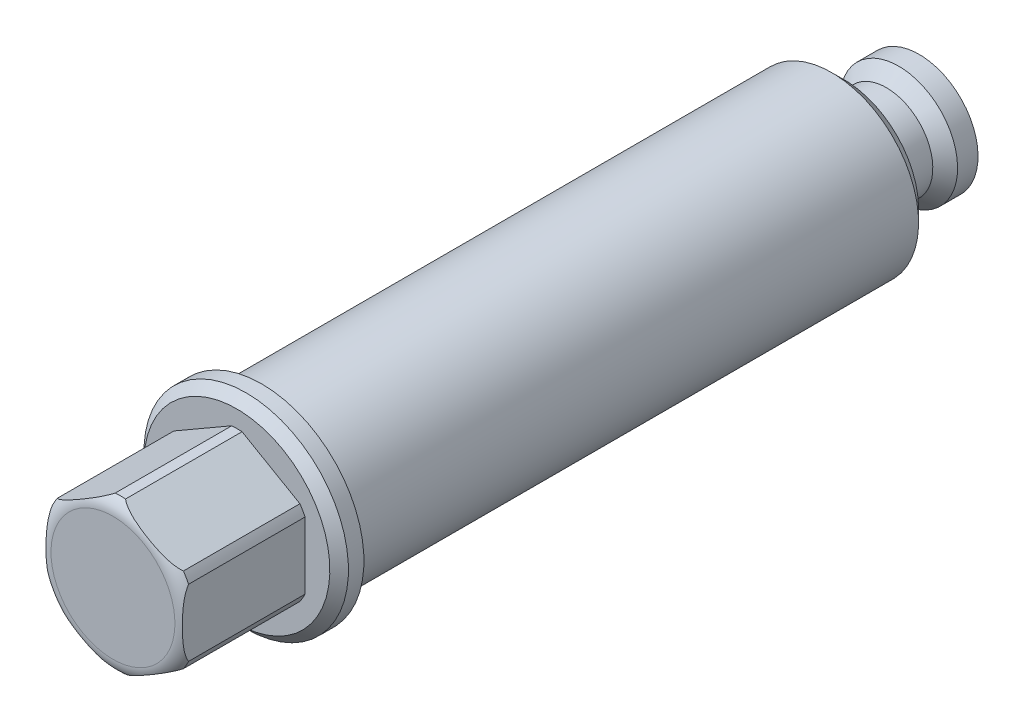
ISO-10303-21;
HEADER;
FILE_DESCRIPTION(('STEP AP214'),'2;1');
FILE_NAME('part.step','',(''),(''),'','','');
FILE_SCHEMA(('AUTOMOTIVE_DESIGN { 1 0 10303 214 1 1 1 1 }'));
ENDSEC;
DATA;
#1=APPLICATION_CONTEXT('core data for automotive mechanical design processes');
#2=APPLICATION_PROTOCOL_DEFINITION('international standard','automotive_design',2000,#1);
#3=PRODUCT_CONTEXT('',#1,'mechanical');
#4=PRODUCT('Part','Part','',(#3));
#5=PRODUCT_RELATED_PRODUCT_CATEGORY('part','',(#4));
#6=PRODUCT_DEFINITION_FORMATION('','',#4);
#7=PRODUCT_DEFINITION_CONTEXT('part definition',#1,'design');
#8=PRODUCT_DEFINITION('design','',#6,#7);
#9=PRODUCT_DEFINITION_SHAPE('','',#8);
#10=(LENGTH_UNIT() NAMED_UNIT(*) SI_UNIT(.MILLI.,.METRE.));
#11=(NAMED_UNIT(*) PLANE_ANGLE_UNIT() SI_UNIT($,.RADIAN.));
#12=(NAMED_UNIT(*) SI_UNIT($,.STERADIAN.) SOLID_ANGLE_UNIT());
#13=UNCERTAINTY_MEASURE_WITH_UNIT(LENGTH_MEASURE(1.E-05),#10,'distance_accuracy_value','');
#14=(GEOMETRIC_REPRESENTATION_CONTEXT(3) GLOBAL_UNCERTAINTY_ASSIGNED_CONTEXT((#13)) GLOBAL_UNIT_ASSIGNED_CONTEXT((#10,
#11,#12)) REPRESENTATION_CONTEXT('',''));
#15=CARTESIAN_POINT('',(0.,0.,0.));
#16=DIRECTION('',(0.,0.,1.));
#17=DIRECTION('',(1.,0.,0.));
#18=AXIS2_PLACEMENT_3D('',#15,#16,#17);
#19=CARTESIAN_POINT('',(11.,-6.35085296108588,133.));
#20=DIRECTION('',(0.,0.,-1.));
#21=DIRECTION('',(-0.866025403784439,0.5,0.));
#22=AXIS2_PLACEMENT_3D('',#19,#20,#21);
#23=PLANE('',#22);
#24=CARTESIAN_POINT('',(0.,0.,133.));
#25=DIRECTION('',(0.,0.,-1.));
#26=DIRECTION('',(0.866025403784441,-0.499999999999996,0.));
#27=AXIS2_PLACEMENT_3D('',#24,#25,#26);
#28=CIRCLE('',#27,10.);
#29=CARTESIAN_POINT('',(8.66025403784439,-5.,133.));
#30=VERTEX_POINT('',#29);
#31=CARTESIAN_POINT('',(-8.66025403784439,5.,133.));
#32=VERTEX_POINT('',#31);
#33=EDGE_CURVE('E180',#30,#32,#28,.T.);
#34=ORIENTED_EDGE('',*,*,#33,.F.);
#35=CARTESIAN_POINT('',(0.,0.,133.));
#36=DIRECTION('',(0.,0.,-1.));
#37=DIRECTION('',(-0.86602540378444,0.499999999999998,0.));
#38=AXIS2_PLACEMENT_3D('',#35,#36,#37);
#39=CIRCLE('',#38,10.);
#40=EDGE_CURVE('E273',#32,#30,#39,.T.);
#41=ORIENTED_EDGE('',*,*,#40,.F.);
#42=EDGE_LOOP('',(#34,#41));
#43=FACE_BOUND('',#42,.T.);
#44=ADVANCED_FACE('F14',(#43),#23,.F.);
#45=CARTESIAN_POINT('',(0.,0.,133.));
#46=DIRECTION('',(0.,0.,1.));
#47=DIRECTION('',(0.866025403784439,-0.5,0.));
#48=AXIS2_PLACEMENT_3D('',#45,#46,#47);
#49=CYLINDRICAL_SURFACE('',#48,12.25);
#50=DIRECTION('',(0.,0.,1.));
#51=VECTOR('',#50,1.);
#52=CARTESIAN_POINT('',(11.,-5.39096466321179,113.));
#53=LINE('',#52,#51);
#54=CARTESIAN_POINT('',(11.,-5.39096466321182,131.793859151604));
#55=VERTEX_POINT('',#54);
#56=CARTESIAN_POINT('',(11.,-5.39096466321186,113.));
#57=VERTEX_POINT('',#56);
#58=EDGE_CURVE('E172',#55,#57,#53,.F.);
#59=ORIENTED_EDGE('',*,*,#58,.F.);
#60=CARTESIAN_POINT('',(0.,0.,131.793859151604));
#61=DIRECTION('',(0.,0.,1.));
#62=DIRECTION('',(0.866025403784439,-0.5,0.));
#63=AXIS2_PLACEMENT_3D('',#60,#61,#62);
#64=CIRCLE('',#63,12.25);
#65=CARTESIAN_POINT('',(10.1687123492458,-6.83079711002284,131.793859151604));
#66=VERTEX_POINT('',#65);
#67=EDGE_CURVE('E129',#66,#55,#64,.T.);
#68=ORIENTED_EDGE('',*,*,#67,.F.);
#69=DIRECTION('',(0.,0.,1.));
#70=VECTOR('',#69,1.);
#71=CARTESIAN_POINT('',(10.1687123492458,-6.83079711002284,113.));
#72=LINE('',#71,#70);
#73=CARTESIAN_POINT('',(10.1687123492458,-6.83079711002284,113.));
#74=VERTEX_POINT('',#73);
#75=EDGE_CURVE('E127',#74,#66,#72,.T.);
#76=ORIENTED_EDGE('',*,*,#75,.F.);
#77=CARTESIAN_POINT('',(0.,0.,113.));
#78=DIRECTION('',(0.,0.,1.));
#79=DIRECTION('',(0.866025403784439,-0.5,0.));
#80=AXIS2_PLACEMENT_3D('',#77,#78,#79);
#81=CIRCLE('',#80,12.25);
#82=EDGE_CURVE('E112',#74,#57,#81,.T.);
#83=ORIENTED_EDGE('',*,*,#82,.T.);
#84=EDGE_LOOP('',(#59,#68,#76,#83));
#85=FACE_BOUND('',#84,.T.);
#86=ADVANCED_FACE('F128',(#85),#49,.T.);
#87=CARTESIAN_POINT('',(0.,0.,133.));
#88=DIRECTION('',(0.,0.,1.));
#89=DIRECTION('',(0.866025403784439,-0.5,0.));
#90=AXIS2_PLACEMENT_3D('',#87,#88,#89);
#91=CYLINDRICAL_SURFACE('',#90,12.25);
#92=CARTESIAN_POINT('',(0.,0.,131.793859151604));
#93=DIRECTION('',(0.,0.,1.));
#94=DIRECTION('',(0.866025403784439,-0.5,0.));
#95=AXIS2_PLACEMENT_3D('',#92,#93,#94);
#96=CIRCLE('',#95,12.25);
#97=CARTESIAN_POINT('',(11.,5.39096466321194,131.793859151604));
#98=VERTEX_POINT('',#97);
#99=CARTESIAN_POINT('',(10.1687123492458,6.83079711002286,131.793859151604));
#100=VERTEX_POINT('',#99);
#101=EDGE_CURVE('E271',#98,#100,#96,.T.);
#102=ORIENTED_EDGE('',*,*,#101,.F.);
#103=DIRECTION('',(0.,0.,1.));
#104=VECTOR('',#103,1.);
#105=CARTESIAN_POINT('',(11.,5.39096466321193,113.));
#106=LINE('',#105,#104);
#107=CARTESIAN_POINT('',(11.,5.39096466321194,113.));
#108=VERTEX_POINT('',#107);
#109=EDGE_CURVE('E175',#108,#98,#106,.T.);
#110=ORIENTED_EDGE('',*,*,#109,.F.);
#111=CARTESIAN_POINT('',(0.,0.,113.));
#112=DIRECTION('',(0.,0.,1.));
#113=DIRECTION('',(0.866025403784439,-0.5,0.));
#114=AXIS2_PLACEMENT_3D('',#111,#112,#113);
#115=CIRCLE('',#114,12.25);
#116=CARTESIAN_POINT('',(10.1687123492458,6.83079711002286,113.));
#117=VERTEX_POINT('',#116);
#118=EDGE_CURVE('E124',#108,#117,#115,.T.);
#119=ORIENTED_EDGE('',*,*,#118,.T.);
#120=DIRECTION('',(0.,0.,1.));
#121=VECTOR('',#120,1.);
#122=CARTESIAN_POINT('',(10.1687123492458,6.83079711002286,113.));
#123=LINE('',#122,#121);
#124=EDGE_CURVE('E165',#100,#117,#123,.F.);
#125=ORIENTED_EDGE('',*,*,#124,.F.);
#126=EDGE_LOOP('',(#102,#110,#119,#125));
#127=FACE_BOUND('',#126,.T.);
#128=ADVANCED_FACE('F262',(#127),#91,.T.);
#129=CARTESIAN_POINT('',(0.,0.,133.));
#130=DIRECTION('',(0.,0.,1.));
#131=DIRECTION('',(0.866025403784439,-0.5,0.));
#132=AXIS2_PLACEMENT_3D('',#129,#130,#131);
#133=CYLINDRICAL_SURFACE('',#132,12.25);
#134=CARTESIAN_POINT('',(0.,0.,113.));
#135=DIRECTION('',(0.,0.,1.));
#136=DIRECTION('',(0.866025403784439,-0.5,0.));
#137=AXIS2_PLACEMENT_3D('',#134,#135,#136);
#138=CIRCLE('',#137,12.25);
#139=CARTESIAN_POINT('',(0.83128765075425,12.2217617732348,113.));
#140=VERTEX_POINT('',#139);
#141=CARTESIAN_POINT('',(-0.831287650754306,12.2217617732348,113.));
#142=VERTEX_POINT('',#141);
#143=EDGE_CURVE('E317',#140,#142,#138,.T.);
#144=ORIENTED_EDGE('',*,*,#143,.T.);
#145=DIRECTION('',(0.,0.,1.));
#146=VECTOR('',#145,1.);
#147=CARTESIAN_POINT('',(-0.831287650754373,12.2217617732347,113.));
#148=LINE('',#147,#146);
#149=CARTESIAN_POINT('',(-0.831287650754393,12.2217617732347,131.793859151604));
#150=VERTEX_POINT('',#149);
#151=EDGE_CURVE('E158',#150,#142,#148,.F.);
#152=ORIENTED_EDGE('',*,*,#151,.F.);
#153=CARTESIAN_POINT('',(0.,0.,131.793859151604));
#154=DIRECTION('',(0.,0.,1.));
#155=DIRECTION('',(0.866025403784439,-0.5,0.));
#156=AXIS2_PLACEMENT_3D('',#153,#154,#155);
#157=CIRCLE('',#156,12.25);
#158=CARTESIAN_POINT('',(0.831287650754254,12.2217617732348,131.793859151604));
#159=VERTEX_POINT('',#158);
#160=EDGE_CURVE('E269',#150,#159,#157,.F.);
#161=ORIENTED_EDGE('',*,*,#160,.T.);
#162=DIRECTION('',(0.,0.,1.));
#163=VECTOR('',#162,1.);
#164=CARTESIAN_POINT('',(0.831287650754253,12.2217617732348,113.));
#165=LINE('',#164,#163);
#166=EDGE_CURVE('E169',#140,#159,#165,.T.);
#167=ORIENTED_EDGE('',*,*,#166,.F.);
#168=EDGE_LOOP('',(#144,#152,#161,#167));
#169=FACE_BOUND('',#168,.T.);
#170=ADVANCED_FACE('F261',(#169),#133,.T.);
#171=CARTESIAN_POINT('',(0.,0.,133.));
#172=DIRECTION('',(0.,0.,1.));
#173=DIRECTION('',(0.866025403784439,-0.5,0.));
#174=AXIS2_PLACEMENT_3D('',#171,#172,#173);
#175=CYLINDRICAL_SURFACE('',#174,12.25);
#176=CARTESIAN_POINT('',(0.,0.,113.));
#177=DIRECTION('',(0.,0.,1.));
#178=DIRECTION('',(0.866025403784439,-0.5,0.));
#179=AXIS2_PLACEMENT_3D('',#176,#177,#178);
#180=CIRCLE('',#179,12.25);
#181=CARTESIAN_POINT('',(-10.1687123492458,6.83079711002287,113.));
#182=VERTEX_POINT('',#181);
#183=CARTESIAN_POINT('',(-11.,5.39096466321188,113.));
#184=VERTEX_POINT('',#183);
#185=EDGE_CURVE('E314',#182,#184,#180,.T.);
#186=ORIENTED_EDGE('',*,*,#185,.T.);
#187=DIRECTION('',(0.,0.,1.));
#188=VECTOR('',#187,1.);
#189=CARTESIAN_POINT('',(-11.,5.39096466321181,113.));
#190=LINE('',#189,#188);
#191=CARTESIAN_POINT('',(-11.,5.39096466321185,131.793859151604));
#192=VERTEX_POINT('',#191);
#193=EDGE_CURVE('E151',#192,#184,#190,.F.);
#194=ORIENTED_EDGE('',*,*,#193,.F.);
#195=CARTESIAN_POINT('',(0.,0.,131.793859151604));
#196=DIRECTION('',(0.,0.,1.));
#197=DIRECTION('',(0.866025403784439,-0.5,0.));
#198=AXIS2_PLACEMENT_3D('',#195,#196,#197);
#199=CIRCLE('',#198,12.25);
#200=CARTESIAN_POINT('',(-10.1687123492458,6.83079711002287,131.793859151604));
#201=VERTEX_POINT('',#200);
#202=EDGE_CURVE('E303',#201,#192,#199,.T.);
#203=ORIENTED_EDGE('',*,*,#202,.F.);
#204=DIRECTION('',(0.,0.,1.));
#205=VECTOR('',#204,1.);
#206=CARTESIAN_POINT('',(-10.1687123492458,6.83079711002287,113.));
#207=LINE('',#206,#205);
#208=EDGE_CURVE('E162',#182,#201,#207,.T.);
#209=ORIENTED_EDGE('',*,*,#208,.F.);
#210=EDGE_LOOP('',(#186,#194,#203,#209));
#211=FACE_BOUND('',#210,.T.);
#212=ADVANCED_FACE('F484',(#211),#175,.T.);
#213=CARTESIAN_POINT('',(0.,0.,133.));
#214=DIRECTION('',(0.,0.,1.));
#215=DIRECTION('',(0.866025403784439,-0.5,0.));
#216=AXIS2_PLACEMENT_3D('',#213,#214,#215);
#217=CYLINDRICAL_SURFACE('',#216,12.25);
#218=CARTESIAN_POINT('',(0.,0.,113.));
#219=DIRECTION('',(0.,0.,1.));
#220=DIRECTION('',(0.866025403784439,-0.5,0.));
#221=AXIS2_PLACEMENT_3D('',#218,#219,#220);
#222=CIRCLE('',#221,12.25);
#223=CARTESIAN_POINT('',(-0.831287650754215,-12.2217617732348,113.));
#224=VERTEX_POINT('',#223);
#225=CARTESIAN_POINT('',(0.831287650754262,-12.2217617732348,113.));
#226=VERTEX_POINT('',#225);
#227=EDGE_CURVE('E307',#224,#226,#222,.T.);
#228=ORIENTED_EDGE('',*,*,#227,.T.);
#229=DIRECTION('',(0.,0.,1.));
#230=VECTOR('',#229,1.);
#231=CARTESIAN_POINT('',(0.831287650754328,-12.2217617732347,113.));
#232=LINE('',#231,#230);
#233=CARTESIAN_POINT('',(0.831287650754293,-12.2217617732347,131.793859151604));
#234=VERTEX_POINT('',#233);
#235=EDGE_CURVE('E139',#234,#226,#232,.F.);
#236=ORIENTED_EDGE('',*,*,#235,.F.);
#237=CARTESIAN_POINT('',(0.,0.,131.793859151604));
#238=DIRECTION('',(0.,0.,1.));
#239=DIRECTION('',(0.866025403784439,-0.5,0.));
#240=AXIS2_PLACEMENT_3D('',#237,#238,#239);
#241=CIRCLE('',#240,12.25);
#242=CARTESIAN_POINT('',(-0.831287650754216,-12.2217617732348,131.793859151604));
#243=VERTEX_POINT('',#242);
#244=EDGE_CURVE('E300',#243,#234,#241,.T.);
#245=ORIENTED_EDGE('',*,*,#244,.F.);
#246=DIRECTION('',(0.,0.,-1.));
#247=VECTOR('',#246,1.);
#248=CARTESIAN_POINT('',(-0.831287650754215,-12.2217617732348,113.));
#249=LINE('',#248,#247);
#250=EDGE_CURVE('E149',#224,#243,#249,.F.);
#251=ORIENTED_EDGE('',*,*,#250,.F.);
#252=EDGE_LOOP('',(#228,#236,#245,#251));
#253=FACE_BOUND('',#252,.T.);
#254=ADVANCED_FACE('F191',(#253),#217,.T.);
#255=CARTESIAN_POINT('',(0.,0.,130.298294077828));
#256=DIRECTION('',(0.,0.,1.));
#257=DIRECTION('',(0.866025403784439,-0.5,0.));
#258=AXIS2_PLACEMENT_3D('',#255,#256,#257);
#259=TOROIDAL_SURFACE('',#258,10.,2.70170592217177);
#260=CARTESIAN_POINT('',(-10.1687123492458,6.83079711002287,131.793859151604));
#261=CARTESIAN_POINT('',(-10.1129325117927,6.86300161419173,131.836482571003));
#262=CARTESIAN_POINT('',(-10.0559059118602,6.89592593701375,131.876855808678));
#263=CARTESIAN_POINT('',(-9.93996765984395,6.9628629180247,131.953381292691));
#264=CARTESIAN_POINT('',(-9.88106158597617,6.99687235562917,131.989544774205));
#265=CARTESIAN_POINT('',(-9.76170288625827,7.06578413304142,132.05813598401));
#266=CARTESIAN_POINT('',(-9.70125131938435,7.10068586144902,132.090566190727));
#267=CARTESIAN_POINT('',(-9.58016618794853,7.17059439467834,132.151521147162));
#268=CARTESIAN_POINT('',(-9.5195547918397,7.20558840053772,132.180104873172));
#269=CARTESIAN_POINT('',(-9.39732105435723,7.27616008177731,132.234347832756));
#270=CARTESIAN_POINT('',(-9.33569812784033,7.31173809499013,132.260005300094));
#271=CARTESIAN_POINT('',(-9.21165950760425,7.38335182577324,132.30865335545));
#272=CARTESIAN_POINT('',(-9.14924366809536,7.41938762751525,132.331643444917));
#273=CARTESIAN_POINT('',(-8.99138382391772,7.51052805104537,132.386452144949));
#274=CARTESIAN_POINT('',(-8.89552952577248,7.5658695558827,132.416698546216));
#275=CARTESIAN_POINT('',(-8.70277268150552,7.67715777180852,132.472386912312));
#276=CARTESIAN_POINT('',(-8.6058698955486,7.73310462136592,132.497827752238));
#277=CARTESIAN_POINT('',(-8.3137912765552,7.90173629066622,132.568003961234));
#278=CARTESIAN_POINT('',(-8.11749038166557,8.01507066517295,132.606511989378));
#279=CARTESIAN_POINT('',(-7.72323299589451,8.2426952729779,132.671143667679));
#280=CARTESIAN_POINT('',(-7.52527491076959,8.35698642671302,132.697253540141));
#281=CARTESIAN_POINT('',(-7.12360101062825,8.58889296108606,132.740582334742));
#282=CARTESIAN_POINT('',(-6.91986619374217,8.70651931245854,132.757559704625));
#283=CARTESIAN_POINT('',(-6.51231016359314,8.94182189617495,132.783809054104));
#284=CARTESIAN_POINT('',(-6.30848940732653,9.05949786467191,132.793091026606));
#285=CARTESIAN_POINT('',(-5.90086638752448,9.2948391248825,132.805276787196));
#286=CARTESIAN_POINT('',(-5.69706422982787,9.41250435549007,132.808185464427));
#287=CARTESIAN_POINT('',(-5.31834568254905,9.6311576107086,132.80805760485));
#288=CARTESIAN_POINT('',(-5.14342867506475,9.7321459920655,132.805805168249));
#289=CARTESIAN_POINT('',(-4.79363062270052,9.93410199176,132.796664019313));
#290=CARTESIAN_POINT('',(-4.61874960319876,10.0350695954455,132.789773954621));
#291=CARTESIAN_POINT('',(-4.26896148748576,10.2370198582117,132.770635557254));
#292=CARTESIAN_POINT('',(-4.09405468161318,10.3380023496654,132.758379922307));
#293=CARTESIAN_POINT('',(-3.74416838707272,10.5400092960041,132.727259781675));
#294=CARTESIAN_POINT('',(-3.56919009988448,10.6410330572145,132.708376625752));
#295=CARTESIAN_POINT('',(-3.22483803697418,10.8398448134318,132.662887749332));
#296=CARTESIAN_POINT('',(-3.05544239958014,10.9376454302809,132.636508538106));
#297=CARTESIAN_POINT('',(-2.71815589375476,11.132377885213,132.57369473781));
#298=CARTESIAN_POINT('',(-2.5502638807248,11.2293103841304,132.53726861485));
#299=CARTESIAN_POINT('',(-2.21755075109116,11.4214023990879,132.451677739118));
#300=CARTESIAN_POINT('',(-2.05272044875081,11.5165672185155,132.402561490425));
#301=CARTESIAN_POINT('',(-1.72770212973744,11.7042166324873,132.28800126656));
#302=CARTESIAN_POINT('',(-1.56750164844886,11.7967084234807,132.222606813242));
#303=CARTESIAN_POINT('',(-1.36101704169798,11.9159223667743,132.122343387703));
#304=CARTESIAN_POINT('',(-1.31126364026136,11.9446475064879,132.09690891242));
#305=CARTESIAN_POINT('',(-1.21270295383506,12.0015515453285,132.043669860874));
#306=CARTESIAN_POINT('',(-1.16389580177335,12.0297303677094,132.015864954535));
#307=CARTESIAN_POINT('',(-1.06692575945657,12.0857160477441,131.957391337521));
#308=CARTESIAN_POINT('',(-1.01877501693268,12.113515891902,131.926695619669));
#309=CARTESIAN_POINT('',(-0.923894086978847,12.1682954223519,131.862461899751));
#310=CARTESIAN_POINT('',(-0.87716447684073,12.1952747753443,131.828922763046));
#311=CARTESIAN_POINT('',(-0.831287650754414,12.2217617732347,131.793859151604));
#312=B_SPLINE_CURVE_WITH_KNOTS('',3,(#260,#261,#262,#263,#264,#265,#266,#267,#268,#269,#270,
#271,#272,#273,#274,#275,#276,#277,#278,#279,#280,#281,#282,#283,#284,#285,#286,#287,#288,#289,
#290,#291,#292,#293,#294,#295,#296,#297,#298,#299,#300,#301,#302,#303,#304,#305,#306,#307,#308,
#309,#310,#311),.UNSPECIFIED.,.F.,.F.,(4,2,2,2,2,2,2,2,2,2,2,2,2,2,2,2,2,2,2,2,2,2,2,2,2,4),(0.,
0.231599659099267,0.462566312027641,0.693378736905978,0.920104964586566,1.14696732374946,
1.3738720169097,1.71795811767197,2.06212466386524,2.75133882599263,3.44131710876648,
4.14874498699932,4.85525278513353,5.56121841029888,6.16713955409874,6.77323746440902,
7.38016282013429,7.98880997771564,8.58072917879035,9.17215111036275,9.76134512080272,
10.3487681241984,10.5372122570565,10.7256826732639,10.9161322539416,11.1066581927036),.UNSPECIFIED.);
#313=EDGE_CURVE('E161',#201,#150,#312,.T.);
#314=ORIENTED_EDGE('',*,*,#313,.F.);
#315=ORIENTED_EDGE('',*,*,#202,.T.);
#316=CARTESIAN_POINT('',(-11.,-5.39096466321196,131.793859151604));
#317=CARTESIAN_POINT('',(-11.,-5.32655565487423,131.836482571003));
#318=CARTESIAN_POINT('',(-11.,-5.26070700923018,131.876855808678));
#319=CARTESIAN_POINT('',(-11.,-5.12683304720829,131.953381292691));
#320=CARTESIAN_POINT('',(-11.,-5.05881417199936,131.989544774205));
#321=CARTESIAN_POINT('',(-11.,-4.92099061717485,132.05813598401));
#322=CARTESIAN_POINT('',(-11.,-4.85118716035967,132.090566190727));
#323=CARTESIAN_POINT('',(-11.,-4.71137009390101,132.151521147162));
#324=CARTESIAN_POINT('',(-11.,-4.64138208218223,132.180104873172));
#325=CARTESIAN_POINT('',(-11.,-4.50023871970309,132.234347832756));
#326=CARTESIAN_POINT('',(-11.,-4.4290826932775,132.260005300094));
#327=CARTESIAN_POINT('',(-11.,-4.28585523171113,132.30865335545));
#328=CARTESIAN_POINT('',(-10.9999999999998,-4.2137836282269,132.331643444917));
#329=CARTESIAN_POINT('',(-10.9999999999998,-4.03150278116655,132.386452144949));
#330=CARTESIAN_POINT('',(-10.9999999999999,-3.92081977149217,132.416698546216));
#331=CARTESIAN_POINT('',(-11.0000000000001,-3.69824333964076,132.472386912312));
#332=CARTESIAN_POINT('',(-11.,-3.58634964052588,132.497827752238));
#333=CARTESIAN_POINT('',(-11.,-3.24908630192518,132.568003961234));
#334=CARTESIAN_POINT('',(-11.,-3.02241755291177,132.606511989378));
#335=CARTESIAN_POINT('',(-11.,-2.56716833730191,132.671143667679));
#336=CARTESIAN_POINT('',(-11.,-2.33858602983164,132.697253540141));
#337=CARTESIAN_POINT('',(-11.,-1.87477296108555,132.740582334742));
#338=CARTESIAN_POINT('',(-11.,-1.63952025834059,132.757559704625));
#339=CARTESIAN_POINT('',(-11.,-1.16891509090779,132.783809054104));
#340=CARTESIAN_POINT('',(-11.,-0.933563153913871,132.793091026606));
#341=CARTESIAN_POINT('',(-11.,-0.462880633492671,132.805276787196));
#342=CARTESIAN_POINT('',(-11.,-0.227550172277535,132.808185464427));
#343=CARTESIAN_POINT('',(-11.,0.209756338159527,132.80805760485));
#344=CARTESIAN_POINT('',(-11.,0.41173310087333,132.805805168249));
#345=CARTESIAN_POINT('',(-11.,0.81564510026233,132.796664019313));
#346=CARTESIAN_POINT('',(-11.,1.01758030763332,132.789773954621));
#347=CARTESIAN_POINT('',(-11.,1.42148083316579,132.770635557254));
#348=CARTESIAN_POINT('',(-11.,1.62344581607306,132.758379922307));
#349=CARTESIAN_POINT('',(-11.,2.02745970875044,132.727259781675));
#350=CARTESIAN_POINT('',(-11.,2.22950723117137,132.708376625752));
#351=CARTESIAN_POINT('',(-11.,2.62713074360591,132.662887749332));
#352=CARTESIAN_POINT('',(-11.0000000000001,2.82273197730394,132.636508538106));
#353=CARTESIAN_POINT('',(-10.9999999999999,3.21219688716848,132.57369473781));
#354=CARTESIAN_POINT('',(-10.9999999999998,3.40606188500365,132.53726861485));
#355=CARTESIAN_POINT('',(-11.0000000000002,3.79024591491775,132.451677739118));
#356=CARTESIAN_POINT('',(-11.0000000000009,3.98057555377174,132.402561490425));
#357=CARTESIAN_POINT('',(-10.9999999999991,4.35587438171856,132.28800126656));
#358=CARTESIAN_POINT('',(-10.9999999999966,4.54085796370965,132.222606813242));
#359=CARTESIAN_POINT('',(-10.9999999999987,4.77928585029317,132.122343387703));
#360=CARTESIAN_POINT('',(-10.9999999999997,4.83673612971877,132.09690891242));
#361=CARTESIAN_POINT('',(-11.0000000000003,4.95054420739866,132.043669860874));
#362=CARTESIAN_POINT('',(-11.0000000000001,5.00690185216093,132.015864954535));
#363=CARTESIAN_POINT('',(-10.9999999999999,5.11887321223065,131.957391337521));
#364=CARTESIAN_POINT('',(-10.9999999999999,5.17447290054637,131.926695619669));
#365=CARTESIAN_POINT('',(-11.,5.28403196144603,131.862461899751));
#366=CARTESIAN_POINT('',(-11.0000000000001,5.33799066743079,131.828922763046));
#367=CARTESIAN_POINT('',(-11.,5.39096466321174,131.793859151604));
#368=B_SPLINE_CURVE_WITH_KNOTS('',3,(#316,#317,#318,#319,#320,#321,#322,#323,#324,#325,#326,
#327,#328,#329,#330,#331,#332,#333,#334,#335,#336,#337,#338,#339,#340,#341,#342,#343,#344,#345,
#346,#347,#348,#349,#350,#351,#352,#353,#354,#355,#356,#357,#358,#359,#360,#361,#362,#363,#364,
#365,#366,#367),.UNSPECIFIED.,.F.,.F.,(4,2,2,2,2,2,2,2,2,2,2,2,2,2,2,2,2,2,2,2,2,2,2,2,2,4),(0.,
0.231599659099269,0.462566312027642,0.693378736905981,0.920104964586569,1.14696732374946,
1.3738720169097,1.71795811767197,2.06212466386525,2.75133882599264,3.44131710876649,
4.14874498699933,4.85525278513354,5.56121841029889,6.16713955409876,6.77323746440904,
7.38016282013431,7.98880997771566,8.58072917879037,9.17215111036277,9.76134512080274,
10.3487681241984,10.5372122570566,10.7256826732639,10.9161322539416,11.1066581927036),.UNSPECIFIED.);
#369=CARTESIAN_POINT('',(-11.,-5.39096466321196,131.793859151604));
#370=VERTEX_POINT('',#369);
#371=EDGE_CURVE('E154',#370,#192,#368,.T.);
#372=ORIENTED_EDGE('',*,*,#371,.F.);
#373=CARTESIAN_POINT('',(0.,0.,131.793859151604));
#374=DIRECTION('',(0.,0.,1.));
#375=DIRECTION('',(0.866025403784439,-0.5,0.));
#376=AXIS2_PLACEMENT_3D('',#373,#374,#375);
#377=CIRCLE('',#376,12.25);
#378=CARTESIAN_POINT('',(-10.1687123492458,-6.83079711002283,131.793859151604));
#379=VERTEX_POINT('',#378);
#380=EDGE_CURVE('E178',#379,#370,#377,.F.);
#381=ORIENTED_EDGE('',*,*,#380,.F.);
#382=CARTESIAN_POINT('',(-0.83128765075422,-12.2217617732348,131.793859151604));
#383=CARTESIAN_POINT('',(-0.887067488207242,-12.1895572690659,131.836482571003));
#384=CARTESIAN_POINT('',(-0.944094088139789,-12.1566329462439,131.876855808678));
#385=CARTESIAN_POINT('',(-1.06003234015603,-12.089695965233,131.953381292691));
#386=CARTESIAN_POINT('',(-1.11893841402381,-12.0556865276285,131.989544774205));
#387=CARTESIAN_POINT('',(-1.23829711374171,-11.9867747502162,132.05813598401));
#388=CARTESIAN_POINT('',(-1.29874868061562,-11.9518730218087,132.090566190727));
#389=CARTESIAN_POINT('',(-1.41983381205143,-11.8819644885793,132.151521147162));
#390=CARTESIAN_POINT('',(-1.48044520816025,-11.8469704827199,132.180104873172));
#391=CARTESIAN_POINT('',(-1.60267894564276,-11.7763988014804,132.234347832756));
#392=CARTESIAN_POINT('',(-1.6643018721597,-11.7408207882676,132.260005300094));
#393=CARTESIAN_POINT('',(-1.78834049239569,-11.6692070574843,132.30865335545));
#394=CARTESIAN_POINT('',(-1.85075633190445,-11.6331712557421,132.331643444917));
#395=CARTESIAN_POINT('',(-2.00861617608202,-11.5420308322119,132.386452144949));
#396=CARTESIAN_POINT('',(-2.10447047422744,-11.4866893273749,132.416698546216));
#397=CARTESIAN_POINT('',(-2.29722731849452,-11.3754011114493,132.472386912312));
#398=CARTESIAN_POINT('',(-2.39413010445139,-11.3194542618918,132.497827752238));
#399=CARTESIAN_POINT('',(-2.68620872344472,-11.1508225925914,132.568003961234));
#400=CARTESIAN_POINT('',(-2.88250961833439,-11.0374882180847,132.606511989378));
#401=CARTESIAN_POINT('',(-3.27676700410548,-10.8098636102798,132.671143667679));
#402=CARTESIAN_POINT('',(-3.47472508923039,-10.6955724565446,132.697253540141));
#403=CARTESIAN_POINT('',(-3.87639898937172,-10.4636659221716,132.740582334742));
#404=CARTESIAN_POINT('',(-4.0801338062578,-10.3460395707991,132.757559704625));
#405=CARTESIAN_POINT('',(-4.48768983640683,-10.1107369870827,132.783809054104));
#406=CARTESIAN_POINT('',(-4.69151059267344,-9.99306101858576,132.793091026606));
#407=CARTESIAN_POINT('',(-5.09913361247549,-9.75771975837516,132.805276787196));
#408=CARTESIAN_POINT('',(-5.3029357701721,-9.6400545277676,132.808185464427));
#409=CARTESIAN_POINT('',(-5.68165431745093,-9.42140127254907,132.80805760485));
#410=CARTESIAN_POINT('',(-5.85657132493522,-9.32041289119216,132.805805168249));
#411=CARTESIAN_POINT('',(-6.20636937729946,-9.11845689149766,132.796664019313));
#412=CARTESIAN_POINT('',(-6.38125039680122,-9.01748928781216,132.789773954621));
#413=CARTESIAN_POINT('',(-6.73103851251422,-8.81553902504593,132.770635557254));
#414=CARTESIAN_POINT('',(-6.90594531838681,-8.7145565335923,132.758379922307));
#415=CARTESIAN_POINT('',(-7.25583161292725,-8.5125495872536,132.727259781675));
#416=CARTESIAN_POINT('',(-7.43080990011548,-8.41152582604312,132.708376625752));
#417=CARTESIAN_POINT('',(-7.77516196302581,-8.21271406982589,132.662887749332));
#418=CARTESIAN_POINT('',(-7.9445576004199,-8.11491345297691,132.636508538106));
#419=CARTESIAN_POINT('',(-8.28184410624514,-7.92018099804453,132.57369473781));
#420=CARTESIAN_POINT('',(-8.44973611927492,-7.82324849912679,132.53726861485));
#421=CARTESIAN_POINT('',(-8.78244924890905,-7.63115648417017,132.451677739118));
#422=CARTESIAN_POINT('',(-8.94727955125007,-7.53599166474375,132.402561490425));
#423=CARTESIAN_POINT('',(-9.27229787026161,-7.34834225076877,132.28800126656));
#424=CARTESIAN_POINT('',(-9.43249835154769,-7.25585045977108,132.222606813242));
#425=CARTESIAN_POINT('',(-9.63898295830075,-7.13663651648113,132.122343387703));
#426=CARTESIAN_POINT('',(-9.68873635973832,-7.10791137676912,132.09690891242));
#427=CARTESIAN_POINT('',(-9.78729704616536,-7.05100733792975,132.043669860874));
#428=CARTESIAN_POINT('',(-9.83610419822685,-7.02282851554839,132.015864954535));
#429=CARTESIAN_POINT('',(-9.93307424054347,-6.96684283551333,131.957391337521));
#430=CARTESIAN_POINT('',(-9.98122498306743,-6.9390429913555,131.926695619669));
#431=CARTESIAN_POINT('',(-10.0761059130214,-6.88426346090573,131.862461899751));
#432=CARTESIAN_POINT('',(-10.1228355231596,-6.85728410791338,131.828922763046));
#433=CARTESIAN_POINT('',(-10.1687123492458,-6.83079711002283,131.793859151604));
#434=B_SPLINE_CURVE_WITH_KNOTS('',3,(#382,#383,#384,#385,#386,#387,#388,#389,#390,#391,#392,
#393,#394,#395,#396,#397,#398,#399,#400,#401,#402,#403,#404,#405,#406,#407,#408,#409,#410,#411,
#412,#413,#414,#415,#416,#417,#418,#419,#420,#421,#422,#423,#424,#425,#426,#427,#428,#429,#430,
#431,#432,#433),.UNSPECIFIED.,.F.,.F.,(4,2,2,2,2,2,2,2,2,2,2,2,2,2,2,2,2,2,2,2,2,2,2,2,2,4),(0.,
0.231599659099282,0.462566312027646,0.693378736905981,0.920104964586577,1.14696732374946,
1.3738720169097,1.71795811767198,2.06212466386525,2.75133882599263,3.44131710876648,
4.14874498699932,4.85525278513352,5.56121841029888,6.16713955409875,6.77323746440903,
7.3801628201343,7.98880997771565,8.58072917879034,9.17215111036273,9.76134512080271,
10.3487681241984,10.5372122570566,10.725682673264,10.9161322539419,11.1066581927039),.UNSPECIFIED.);
#435=EDGE_CURVE('E145',#243,#379,#434,.T.);
#436=ORIENTED_EDGE('',*,*,#435,.F.);
#437=ORIENTED_EDGE('',*,*,#244,.T.);
#438=CARTESIAN_POINT('',(10.1687123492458,-6.83079711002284,131.793859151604));
#439=CARTESIAN_POINT('',(10.1129325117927,-6.8630016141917,131.836482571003));
#440=CARTESIAN_POINT('',(10.0559059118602,-6.89592593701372,131.876855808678));
#441=CARTESIAN_POINT('',(9.93996765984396,-6.96286291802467,131.953381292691));
#442=CARTESIAN_POINT('',(9.88106158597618,-6.99687235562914,131.989544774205));
#443=CARTESIAN_POINT('',(9.76170288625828,-7.06578413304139,132.05813598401));
#444=CARTESIAN_POINT('',(9.70125131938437,-7.10068586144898,132.090566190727));
#445=CARTESIAN_POINT('',(9.58016618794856,-7.1705943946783,132.151521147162));
#446=CARTESIAN_POINT('',(9.51955479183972,-7.20558840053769,132.180104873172));
#447=CARTESIAN_POINT('',(9.39732105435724,-7.27616008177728,132.234347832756));
#448=CARTESIAN_POINT('',(9.33569812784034,-7.3117380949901,132.260005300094));
#449=CARTESIAN_POINT('',(9.21165950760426,-7.38335182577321,132.30865335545));
#450=CARTESIAN_POINT('',(9.14924366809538,-7.41938762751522,132.331643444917));
#451=CARTESIAN_POINT('',(8.99138382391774,-7.51052805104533,132.386452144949));
#452=CARTESIAN_POINT('',(8.89552952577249,-7.56586955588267,132.416698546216));
#453=CARTESIAN_POINT('',(8.70277268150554,-7.67715777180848,132.472386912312));
#454=CARTESIAN_POINT('',(8.60586989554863,-7.73310462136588,132.497827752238));
#455=CARTESIAN_POINT('',(8.31379127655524,-7.90173629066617,132.568003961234));
#456=CARTESIAN_POINT('',(8.1174903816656,-8.01507066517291,132.606511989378));
#457=CARTESIAN_POINT('',(7.72323299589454,-8.24269527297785,132.671143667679));
#458=CARTESIAN_POINT('',(7.52527491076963,-8.35698642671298,132.697253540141));
#459=CARTESIAN_POINT('',(7.12360101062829,-8.58889296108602,132.740582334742));
#460=CARTESIAN_POINT('',(6.91986619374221,-8.7065193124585,132.757559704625));
#461=CARTESIAN_POINT('',(6.51231016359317,-8.9418218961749,132.783809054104));
#462=CARTESIAN_POINT('',(6.30848940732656,-9.05949786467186,132.793091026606));
#463=CARTESIAN_POINT('',(5.90086638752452,-9.29483912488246,132.805276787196));
#464=CARTESIAN_POINT('',(5.69706422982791,-9.41250435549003,132.808185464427));
#465=CARTESIAN_POINT('',(5.31834568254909,-9.63115761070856,132.80805760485));
#466=CARTESIAN_POINT('',(5.14342867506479,-9.73214599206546,132.805805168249));
#467=CARTESIAN_POINT('',(4.79363062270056,-9.93410199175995,132.796664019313));
#468=CARTESIAN_POINT('',(4.6187496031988,-10.0350695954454,132.789773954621));
#469=CARTESIAN_POINT('',(4.2689614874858,-10.2370198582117,132.770635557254));
#470=CARTESIAN_POINT('',(4.09405468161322,-10.3380023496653,132.758379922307));
#471=CARTESIAN_POINT('',(3.74416838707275,-10.540009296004,132.727259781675));
#472=CARTESIAN_POINT('',(3.5691900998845,-10.6410330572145,132.708376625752));
#473=CARTESIAN_POINT('',(3.22483803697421,-10.8398448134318,132.662887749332));
#474=CARTESIAN_POINT('',(3.05544239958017,-10.9376454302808,132.636508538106));
#475=CARTESIAN_POINT('',(2.71815589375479,-11.132377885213,132.57369473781));
#476=CARTESIAN_POINT('',(2.55026388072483,-11.2293103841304,132.53726861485));
#477=CARTESIAN_POINT('',(2.21755075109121,-11.4214023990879,132.451677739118));
#478=CARTESIAN_POINT('',(2.05272044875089,-11.5165672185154,132.402561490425));
#479=CARTESIAN_POINT('',(1.72770212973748,-11.7042166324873,132.28800126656));
#480=CARTESIAN_POINT('',(1.56750164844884,-11.7967084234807,132.222606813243));
#481=CARTESIAN_POINT('',(1.36101704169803,-11.9159223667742,132.122343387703));
#482=CARTESIAN_POINT('',(1.31126364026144,-11.9446475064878,132.09690891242));
#483=CARTESIAN_POINT('',(1.21270295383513,-12.0015515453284,132.043669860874));
#484=CARTESIAN_POINT('',(1.1638958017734,-12.0297303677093,132.015864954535));
#485=CARTESIAN_POINT('',(1.06692575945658,-12.085716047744,131.957391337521));
#486=CARTESIAN_POINT('',(1.01877501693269,-12.1135158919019,131.926695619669));
#487=CARTESIAN_POINT('',(0.923894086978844,-12.1682954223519,131.862461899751));
#488=CARTESIAN_POINT('',(0.877164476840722,-12.1952747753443,131.828922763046));
#489=CARTESIAN_POINT('',(0.831287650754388,-12.2217617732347,131.793859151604));
#490=B_SPLINE_CURVE_WITH_KNOTS('',3,(#438,#439,#440,#441,#442,#443,#444,#445,#446,#447,#448,
#449,#450,#451,#452,#453,#454,#455,#456,#457,#458,#459,#460,#461,#462,#463,#464,#465,#466,#467,
#468,#469,#470,#471,#472,#473,#474,#475,#476,#477,#478,#479,#480,#481,#482,#483,#484,#485,#486,
#487,#488,#489),.UNSPECIFIED.,.F.,.F.,(4,2,2,2,2,2,2,2,2,2,2,2,2,2,2,2,2,2,2,2,2,2,2,2,2,4),(0.,
0.231599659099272,0.462566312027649,0.693378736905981,0.920104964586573,1.14696732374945,
1.3738720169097,1.71795811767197,2.06212466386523,2.75133882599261,3.44131710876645,
4.1487449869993,4.85525278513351,5.56121841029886,6.16713955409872,6.77323746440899,
7.38016282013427,7.98880997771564,8.58072917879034,9.17215111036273,9.76134512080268,
10.3487681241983,10.5372122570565,10.7256826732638,10.9161322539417,11.1066581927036),.UNSPECIFIED.);
#491=EDGE_CURVE('E133',#66,#234,#490,.T.);
#492=ORIENTED_EDGE('',*,*,#491,.F.);
#493=ORIENTED_EDGE('',*,*,#67,.T.);
#494=CARTESIAN_POINT('',(11.,5.39096466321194,131.793859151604));
#495=CARTESIAN_POINT('',(11.,5.32655565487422,131.836482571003));
#496=CARTESIAN_POINT('',(11.,5.26070700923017,131.876855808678));
#497=CARTESIAN_POINT('',(11.,5.12683304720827,131.953381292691));
#498=CARTESIAN_POINT('',(11.,5.05881417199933,131.989544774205));
#499=CARTESIAN_POINT('',(11.,4.92099061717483,132.05813598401));
#500=CARTESIAN_POINT('',(11.,4.85118716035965,132.090566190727));
#501=CARTESIAN_POINT('',(11.,4.711370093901,132.151521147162));
#502=CARTESIAN_POINT('',(11.,4.64138208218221,132.180104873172));
#503=CARTESIAN_POINT('',(11.,4.50023871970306,132.234347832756));
#504=CARTESIAN_POINT('',(11.,4.42908269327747,132.260005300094));
#505=CARTESIAN_POINT('',(11.,4.28585523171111,132.30865335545));
#506=CARTESIAN_POINT('',(10.9999999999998,4.21378362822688,132.331643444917));
#507=CARTESIAN_POINT('',(10.9999999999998,4.03150278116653,132.386452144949));
#508=CARTESIAN_POINT('',(10.9999999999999,3.92081977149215,132.416698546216));
#509=CARTESIAN_POINT('',(11.0000000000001,3.69824333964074,132.472386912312));
#510=CARTESIAN_POINT('',(11.,3.58634964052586,132.497827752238));
#511=CARTESIAN_POINT('',(11.,3.24908630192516,132.568003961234));
#512=CARTESIAN_POINT('',(11.,3.02241755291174,132.606511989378));
#513=CARTESIAN_POINT('',(11.,2.56716833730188,132.671143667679));
#514=CARTESIAN_POINT('',(11.,2.33858602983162,132.697253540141));
#515=CARTESIAN_POINT('',(11.,1.87477296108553,132.740582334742));
#516=CARTESIAN_POINT('',(11.,1.63952025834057,132.757559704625));
#517=CARTESIAN_POINT('',(11.,1.16891509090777,132.783809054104));
#518=CARTESIAN_POINT('',(11.,0.933563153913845,132.793091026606));
#519=CARTESIAN_POINT('',(11.,0.462880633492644,132.805276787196));
#520=CARTESIAN_POINT('',(11.,0.227550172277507,132.808185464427));
#521=CARTESIAN_POINT('',(11.,-0.209756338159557,132.80805760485));
#522=CARTESIAN_POINT('',(11.,-0.411733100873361,132.805805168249));
#523=CARTESIAN_POINT('',(11.,-0.815645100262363,132.796664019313));
#524=CARTESIAN_POINT('',(11.,-1.01758030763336,132.789773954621));
#525=CARTESIAN_POINT('',(11.,-1.42148083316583,132.770635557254));
#526=CARTESIAN_POINT('',(11.,-1.6234458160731,132.758379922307));
#527=CARTESIAN_POINT('',(11.,-2.02745970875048,132.727259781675));
#528=CARTESIAN_POINT('',(11.,-2.22950723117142,132.708376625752));
#529=CARTESIAN_POINT('',(11.,-2.62713074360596,132.662887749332));
#530=CARTESIAN_POINT('',(11.0000000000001,-2.82273197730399,132.636508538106));
#531=CARTESIAN_POINT('',(10.9999999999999,-3.21219688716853,132.57369473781));
#532=CARTESIAN_POINT('',(10.9999999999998,-3.4060618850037,132.53726861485));
#533=CARTESIAN_POINT('',(11.0000000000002,-3.79024591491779,132.451677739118));
#534=CARTESIAN_POINT('',(11.0000000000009,-3.98057555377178,132.402561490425));
#535=CARTESIAN_POINT('',(10.9999999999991,-4.3558743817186,132.28800126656));
#536=CARTESIAN_POINT('',(10.9999999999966,-4.54085796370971,132.222606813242));
#537=CARTESIAN_POINT('',(10.9999999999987,-4.7792858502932,132.122343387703));
#538=CARTESIAN_POINT('',(10.9999999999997,-4.83673612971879,132.09690891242));
#539=CARTESIAN_POINT('',(11.0000000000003,-4.95054420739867,132.043669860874));
#540=CARTESIAN_POINT('',(11.0000000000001,-5.00690185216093,132.015864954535));
#541=CARTESIAN_POINT('',(10.9999999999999,-5.11887321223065,131.957391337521));
#542=CARTESIAN_POINT('',(10.9999999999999,-5.17447290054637,131.926695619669));
#543=CARTESIAN_POINT('',(11.,-5.28403196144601,131.862461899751));
#544=CARTESIAN_POINT('',(11.0000000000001,-5.33799066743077,131.828922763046));
#545=CARTESIAN_POINT('',(11.,-5.39096466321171,131.793859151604));
#546=B_SPLINE_CURVE_WITH_KNOTS('',3,(#494,#495,#496,#497,#498,#499,#500,#501,#502,#503,#504,
#505,#506,#507,#508,#509,#510,#511,#512,#513,#514,#515,#516,#517,#518,#519,#520,#521,#522,#523,
#524,#525,#526,#527,#528,#529,#530,#531,#532,#533,#534,#535,#536,#537,#538,#539,#540,#541,#542,
#543,#544,#545),.UNSPECIFIED.,.F.,.F.,(4,2,2,2,2,2,2,2,2,2,2,2,2,2,2,2,2,2,2,2,2,2,2,2,2,4),(0.,
0.231599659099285,0.462566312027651,0.693378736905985,0.92010496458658,1.14696732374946,
1.37387201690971,1.71795811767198,2.06212466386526,2.75133882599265,3.44131710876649,
4.14874498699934,4.85525278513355,5.56121841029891,6.16713955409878,6.77323746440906,
7.38016282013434,7.98880997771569,8.5807291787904,9.17215111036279,9.76134512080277,
10.3487681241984,10.5372122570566,10.7256826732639,10.9161322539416,11.1066581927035),.UNSPECIFIED.);
#547=EDGE_CURVE('E174',#98,#55,#546,.T.);
#548=ORIENTED_EDGE('',*,*,#547,.F.);
#549=ORIENTED_EDGE('',*,*,#101,.T.);
#550=CARTESIAN_POINT('',(0.831287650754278,12.2217617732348,131.793859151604));
#551=CARTESIAN_POINT('',(0.887067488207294,12.1895572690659,131.836482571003));
#552=CARTESIAN_POINT('',(0.94409408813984,12.1566329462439,131.876855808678));
#553=CARTESIAN_POINT('',(1.06003234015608,12.0896959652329,131.953381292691));
#554=CARTESIAN_POINT('',(1.11893841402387,12.0556865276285,131.989544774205));
#555=CARTESIAN_POINT('',(1.23829711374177,11.9867747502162,132.05813598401));
#556=CARTESIAN_POINT('',(1.29874868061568,11.9518730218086,132.090566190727));
#557=CARTESIAN_POINT('',(1.41983381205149,11.8819644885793,132.151521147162));
#558=CARTESIAN_POINT('',(1.48044520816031,11.8469704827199,132.180104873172));
#559=CARTESIAN_POINT('',(1.60267894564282,11.7763988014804,132.234347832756));
#560=CARTESIAN_POINT('',(1.66430187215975,11.7408207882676,132.260005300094));
#561=CARTESIAN_POINT('',(1.78834049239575,11.6692070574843,132.30865335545));
#562=CARTESIAN_POINT('',(1.85075633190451,11.6331712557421,132.331643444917));
#563=CARTESIAN_POINT('',(2.00861617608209,11.5420308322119,132.386452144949));
#564=CARTESIAN_POINT('',(2.1044704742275,11.4866893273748,132.416698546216));
#565=CARTESIAN_POINT('',(2.29722731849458,11.3754011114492,132.472386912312));
#566=CARTESIAN_POINT('',(2.39413010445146,11.3194542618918,132.497827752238));
#567=CARTESIAN_POINT('',(2.6862087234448,11.1508225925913,132.568003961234));
#568=CARTESIAN_POINT('',(2.88250961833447,11.0374882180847,132.606511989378));
#569=CARTESIAN_POINT('',(3.27676700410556,10.8098636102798,132.671143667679));
#570=CARTESIAN_POINT('',(3.47472508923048,10.6955724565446,132.697253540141));
#571=CARTESIAN_POINT('',(3.87639898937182,10.4636659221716,132.740582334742));
#572=CARTESIAN_POINT('',(4.0801338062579,10.3460395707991,132.757559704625));
#573=CARTESIAN_POINT('',(4.48768983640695,10.1107369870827,132.783809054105));
#574=CARTESIAN_POINT('',(4.69151059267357,9.9930610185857,132.793091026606));
#575=CARTESIAN_POINT('',(5.09913361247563,9.7577197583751,132.805276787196));
#576=CARTESIAN_POINT('',(5.30293577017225,9.64005452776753,132.808185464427));
#577=CARTESIAN_POINT('',(5.68165431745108,9.42140127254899,132.80805760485));
#578=CARTESIAN_POINT('',(5.85657132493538,9.32041289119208,132.805805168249));
#579=CARTESIAN_POINT('',(6.20636937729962,9.11845689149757,132.796664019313));
#580=CARTESIAN_POINT('',(6.38125039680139,9.01748928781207,132.789773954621));
#581=CARTESIAN_POINT('',(6.73103851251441,8.81553902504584,132.770635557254));
#582=CARTESIAN_POINT('',(6.90594531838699,8.71455653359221,132.758379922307));
#583=CARTESIAN_POINT('',(7.25583161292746,8.5125495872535,132.727259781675));
#584=CARTESIAN_POINT('',(7.43080990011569,8.41152582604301,132.708376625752));
#585=CARTESIAN_POINT('',(7.77516196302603,8.21271406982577,132.662887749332));
#586=CARTESIAN_POINT('',(7.94455760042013,8.11491345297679,132.636508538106));
#587=CARTESIAN_POINT('',(8.28184410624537,7.92018099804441,132.57369473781));
#588=CARTESIAN_POINT('',(8.44973611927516,7.82324849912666,132.53726861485));
#589=CARTESIAN_POINT('',(8.78244924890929,7.63115648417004,132.451677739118));
#590=CARTESIAN_POINT('',(8.94727955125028,7.53599166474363,132.402561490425));
#591=CARTESIAN_POINT('',(9.27229787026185,7.34834225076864,132.28800126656));
#592=CARTESIAN_POINT('',(9.43249835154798,7.25585045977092,132.222606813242));
#593=CARTESIAN_POINT('',(9.63898295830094,7.13663651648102,132.122343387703));
#594=CARTESIAN_POINT('',(9.68873635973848,7.10791137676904,132.09690891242));
#595=CARTESIAN_POINT('',(9.78729704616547,7.0510073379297,132.043669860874));
#596=CARTESIAN_POINT('',(9.83610419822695,7.02282851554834,132.015864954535));
#597=CARTESIAN_POINT('',(9.93307424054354,6.9668428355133,131.957391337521));
#598=CARTESIAN_POINT('',(9.98122498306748,6.93904299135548,131.926695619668));
#599=CARTESIAN_POINT('',(10.0761059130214,6.88426346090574,131.862461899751));
#600=CARTESIAN_POINT('',(10.1228355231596,6.85728410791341,131.828922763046));
#601=CARTESIAN_POINT('',(10.1687123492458,6.83079711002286,131.793859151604));
#602=B_SPLINE_CURVE_WITH_KNOTS('',3,(#550,#551,#552,#553,#554,#555,#556,#557,#558,#559,#560,
#561,#562,#563,#564,#565,#566,#567,#568,#569,#570,#571,#572,#573,#574,#575,#576,#577,#578,#579,
#580,#581,#582,#583,#584,#585,#586,#587,#588,#589,#590,#591,#592,#593,#594,#595,#596,#597,#598,
#599,#600,#601),.UNSPECIFIED.,.F.,.F.,(4,2,2,2,2,2,2,2,2,2,2,2,2,2,2,2,2,2,2,2,2,2,2,2,2,4),(0.,
0.231599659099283,0.462566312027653,0.693378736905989,0.920104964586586,1.14696732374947,
1.37387201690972,1.717958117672,2.06212466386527,2.75133882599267,3.44131710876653,
4.14874498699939,4.85525278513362,5.56121841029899,6.16713955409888,6.77323746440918,
7.38016282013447,7.98880997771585,8.58072917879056,9.17215111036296,9.76134512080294,
10.3487681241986,10.5372122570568,10.7256826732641,10.9161322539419,11.1066581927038),.UNSPECIFIED.);
#603=EDGE_CURVE('E168',#159,#100,#602,.T.);
#604=ORIENTED_EDGE('',*,*,#603,.F.);
#605=ORIENTED_EDGE('',*,*,#160,.F.);
#606=EDGE_LOOP('',(#314,#315,#372,#381,#436,#437,#492,#493,#548,#549,#604,#605));
#607=FACE_BOUND('',#606,.T.);
#608=ORIENTED_EDGE('',*,*,#33,.T.);
#609=ORIENTED_EDGE('',*,*,#40,.T.);
#610=EDGE_LOOP('',(#608,#609));
#611=FACE_BOUND('',#610,.T.);
#612=ADVANCED_FACE('F185',(#607,#611),#259,.T.);
#613=CARTESIAN_POINT('',(0.,0.,133.));
#614=DIRECTION('',(0.,0.,1.));
#615=DIRECTION('',(0.866025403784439,-0.5,0.));
#616=AXIS2_PLACEMENT_3D('',#613,#614,#615);
#617=CYLINDRICAL_SURFACE('',#616,12.25);
#618=CARTESIAN_POINT('',(0.,0.,113.));
#619=DIRECTION('',(0.,0.,1.));
#620=DIRECTION('',(0.866025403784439,-0.5,0.));
#621=AXIS2_PLACEMENT_3D('',#618,#619,#620);
#622=CIRCLE('',#621,12.25);
#623=CARTESIAN_POINT('',(-11.,-5.39096466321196,113.));
#624=VERTEX_POINT('',#623);
#625=CARTESIAN_POINT('',(-10.1687123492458,-6.83079711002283,113.));
#626=VERTEX_POINT('',#625);
#627=EDGE_CURVE('E134',#624,#626,#622,.T.);
#628=ORIENTED_EDGE('',*,*,#627,.T.);
#629=DIRECTION('',(0.,0.,-1.));
#630=VECTOR('',#629,1.);
#631=CARTESIAN_POINT('',(-10.1687123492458,-6.83079711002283,113.));
#632=LINE('',#631,#630);
#633=EDGE_CURVE('E140',#379,#626,#632,.T.);
#634=ORIENTED_EDGE('',*,*,#633,.F.);
#635=ORIENTED_EDGE('',*,*,#380,.T.);
#636=DIRECTION('',(0.,0.,1.));
#637=VECTOR('',#636,1.);
#638=CARTESIAN_POINT('',(-11.,-5.39096466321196,113.));
#639=LINE('',#638,#637);
#640=EDGE_CURVE('E155',#624,#370,#639,.T.);
#641=ORIENTED_EDGE('',*,*,#640,.F.);
#642=EDGE_LOOP('',(#628,#634,#635,#641));
#643=FACE_BOUND('',#642,.T.);
#644=ADVANCED_FACE('F190',(#643),#617,.T.);
#645=CARTESIAN_POINT('',(0.,-12.7017059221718,113.));
#646=DIRECTION('',(0.5,-0.866025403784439,0.));
#647=DIRECTION('',(0.866025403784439,0.5,0.));
#648=AXIS2_PLACEMENT_3D('',#645,#646,#647);
#649=PLANE('',#648);
#650=ORIENTED_EDGE('',*,*,#491,.T.);
#651=ORIENTED_EDGE('',*,*,#235,.T.);
#652=DIRECTION('',(0.866025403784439,0.5,0.));
#653=VECTOR('',#652,1.);
#654=CARTESIAN_POINT('',(0.831287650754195,-12.2217617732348,113.));
#655=LINE('',#654,#653);
#656=EDGE_CURVE('E121',#226,#74,#655,.T.);
#657=ORIENTED_EDGE('',*,*,#656,.T.);
#658=ORIENTED_EDGE('',*,*,#75,.T.);
#659=EDGE_LOOP('',(#650,#651,#657,#658));
#660=FACE_BOUND('',#659,.T.);
#661=ADVANCED_FACE('F137',(#660),#649,.T.);
#662=CARTESIAN_POINT('',(11.,-6.35085296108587,113.));
#663=DIRECTION('',(1.,0.,0.));
#664=DIRECTION('',(0.,1.,0.));
#665=AXIS2_PLACEMENT_3D('',#662,#663,#664);
#666=PLANE('',#665);
#667=ORIENTED_EDGE('',*,*,#547,.T.);
#668=ORIENTED_EDGE('',*,*,#58,.T.);
#669=DIRECTION('',(0.,1.,0.));
#670=VECTOR('',#669,1.);
#671=CARTESIAN_POINT('',(11.,-5.39096466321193,113.));
#672=LINE('',#671,#670);
#673=EDGE_CURVE('E123',#57,#108,#672,.T.);
#674=ORIENTED_EDGE('',*,*,#673,.T.);
#675=ORIENTED_EDGE('',*,*,#109,.T.);
#676=EDGE_LOOP('',(#667,#668,#674,#675));
#677=FACE_BOUND('',#676,.T.);
#678=ADVANCED_FACE('F236',(#677),#666,.T.);
#679=CARTESIAN_POINT('',(11.,6.35085296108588,113.));
#680=DIRECTION('',(0.5,0.866025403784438,0.));
#681=DIRECTION('',(-0.866025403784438,0.5,0.));
#682=AXIS2_PLACEMENT_3D('',#679,#680,#681);
#683=PLANE('',#682);
#684=ORIENTED_EDGE('',*,*,#603,.T.);
#685=ORIENTED_EDGE('',*,*,#124,.T.);
#686=DIRECTION('',(-0.866025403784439,0.5,0.));
#687=VECTOR('',#686,1.);
#688=CARTESIAN_POINT('',(5.5,9.52627944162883,113.));
#689=LINE('',#688,#687);
#690=EDGE_CURVE('E142',#117,#140,#689,.T.);
#691=ORIENTED_EDGE('',*,*,#690,.T.);
#692=ORIENTED_EDGE('',*,*,#166,.T.);
#693=EDGE_LOOP('',(#684,#685,#691,#692));
#694=FACE_BOUND('',#693,.T.);
#695=ADVANCED_FACE('F240',(#694),#683,.T.);
#696=CARTESIAN_POINT('',(0.,12.7017059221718,113.));
#697=DIRECTION('',(-0.5,0.866025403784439,0.));
#698=DIRECTION('',(-0.866025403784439,-0.5,0.));
#699=AXIS2_PLACEMENT_3D('',#696,#697,#698);
#700=PLANE('',#699);
#701=ORIENTED_EDGE('',*,*,#313,.T.);
#702=ORIENTED_EDGE('',*,*,#151,.T.);
#703=DIRECTION('',(-0.866025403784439,-0.5,0.));
#704=VECTOR('',#703,1.);
#705=CARTESIAN_POINT('',(-0.831287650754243,12.2217617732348,113.));
#706=LINE('',#705,#704);
#707=EDGE_CURVE('E462',#142,#182,#706,.T.);
#708=ORIENTED_EDGE('',*,*,#707,.T.);
#709=ORIENTED_EDGE('',*,*,#208,.T.);
#710=EDGE_LOOP('',(#701,#702,#708,#709));
#711=FACE_BOUND('',#710,.T.);
#712=ADVANCED_FACE('F245',(#711),#700,.T.);
#713=CARTESIAN_POINT('',(-11.,6.3508529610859,113.));
#714=DIRECTION('',(-1.,0.,0.));
#715=DIRECTION('',(0.,-1.,0.));
#716=AXIS2_PLACEMENT_3D('',#713,#714,#715);
#717=PLANE('',#716);
#718=ORIENTED_EDGE('',*,*,#371,.T.);
#719=ORIENTED_EDGE('',*,*,#193,.T.);
#720=DIRECTION('',(0.,-1.,0.));
#721=VECTOR('',#720,1.);
#722=CARTESIAN_POINT('',(-11.,5.39096466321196,113.));
#723=LINE('',#722,#721);
#724=EDGE_CURVE('E460',#184,#624,#723,.T.);
#725=ORIENTED_EDGE('',*,*,#724,.T.);
#726=ORIENTED_EDGE('',*,*,#640,.T.);
#727=EDGE_LOOP('',(#718,#719,#725,#726));
#728=FACE_BOUND('',#727,.T.);
#729=ADVANCED_FACE('F413',(#728),#717,.T.);
#730=CARTESIAN_POINT('',(-11.,-6.35085296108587,113.));
#731=DIRECTION('',(-0.5,-0.866025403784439,0.));
#732=DIRECTION('',(0.,0.,-1.));
#733=AXIS2_PLACEMENT_3D('',#730,#731,#732);
#734=PLANE('',#733);
#735=ORIENTED_EDGE('',*,*,#435,.T.);
#736=ORIENTED_EDGE('',*,*,#633,.T.);
#737=DIRECTION('',(-0.866025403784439,0.5,0.));
#738=VECTOR('',#737,1.);
#739=CARTESIAN_POINT('',(-5.5,-9.52627944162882,113.));
#740=LINE('',#739,#738);
#741=EDGE_CURVE('E399',#626,#224,#740,.F.);
#742=ORIENTED_EDGE('',*,*,#741,.T.);
#743=ORIENTED_EDGE('',*,*,#250,.T.);
#744=EDGE_LOOP('',(#735,#736,#742,#743));
#745=FACE_BOUND('',#744,.T.);
#746=ADVANCED_FACE('F410',(#745),#734,.T.);
#747=CARTESIAN_POINT('',(0.,0.,113.));
#748=DIRECTION('',(0.,0.,-1.));
#749=DIRECTION('',(-0.866025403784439,0.5,0.));
#750=AXIS2_PLACEMENT_3D('',#747,#748,#749);
#751=PLANE('',#750);
#752=ORIENTED_EDGE('',*,*,#741,.F.);
#753=ORIENTED_EDGE('',*,*,#627,.F.);
#754=ORIENTED_EDGE('',*,*,#724,.F.);
#755=ORIENTED_EDGE('',*,*,#185,.F.);
#756=ORIENTED_EDGE('',*,*,#707,.F.);
#757=ORIENTED_EDGE('',*,*,#143,.F.);
#758=ORIENTED_EDGE('',*,*,#690,.F.);
#759=ORIENTED_EDGE('',*,*,#118,.F.);
#760=ORIENTED_EDGE('',*,*,#673,.F.);
#761=ORIENTED_EDGE('',*,*,#82,.F.);
#762=ORIENTED_EDGE('',*,*,#656,.F.);
#763=ORIENTED_EDGE('',*,*,#227,.F.);
#764=EDGE_LOOP('',(#752,#753,#754,#755,#756,#757,#758,#759,#760,#761,#762,#763));
#765=FACE_BOUND('',#764,.T.);
#766=CARTESIAN_POINT('',(0.,0.,113.));
#767=DIRECTION('',(0.,0.,-1.));
#768=DIRECTION('',(-0.866025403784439,0.5,0.));
#769=AXIS2_PLACEMENT_3D('',#766,#767,#768);
#770=CIRCLE('',#769,15.);
#771=CARTESIAN_POINT('',(-12.9903810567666,7.5,113.));
#772=VERTEX_POINT('',#771);
#773=EDGE_CURVE('E455',#772,#772,#770,.T.);
#774=ORIENTED_EDGE('',*,*,#773,.F.);
#775=EDGE_LOOP('',(#774));
#776=FACE_BOUND('',#775,.T.);
#777=ADVANCED_FACE('F118',(#765,#776),#751,.F.);
#778=CARTESIAN_POINT('',(0.,0.,111.5));
#779=DIRECTION('',(0.,0.,-1.));
#780=DIRECTION('',(-0.866025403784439,0.5,0.));
#781=AXIS2_PLACEMENT_3D('',#778,#779,#780);
#782=CONICAL_SURFACE('',#781,16.5,0.785398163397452);
#783=CARTESIAN_POINT('',(0.,0.,111.5));
#784=DIRECTION('',(0.,0.,1.));
#785=DIRECTION('',(0.866025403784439,-0.5,0.));
#786=AXIS2_PLACEMENT_3D('',#783,#784,#785);
#787=CIRCLE('',#786,16.5);
#788=CARTESIAN_POINT('',(14.2894191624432,-8.25,111.5));
#789=VERTEX_POINT('',#788);
#790=EDGE_CURVE('E393',#789,#789,#787,.F.);
#791=ORIENTED_EDGE('',*,*,#790,.F.);
#792=EDGE_LOOP('',(#791));
#793=FACE_BOUND('',#792,.T.);
#794=ORIENTED_EDGE('',*,*,#773,.T.);
#795=EDGE_LOOP('',(#794));
#796=FACE_BOUND('',#795,.T.);
#797=ADVANCED_FACE('F407',(#793,#796),#782,.T.);
#798=CARTESIAN_POINT('',(0.,0.,109.));
#799=DIRECTION('',(0.,0.,1.));
#800=DIRECTION('',(0.866025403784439,-0.5,0.));
#801=AXIS2_PLACEMENT_3D('',#798,#799,#800);
#802=CYLINDRICAL_SURFACE('',#801,16.5);
#803=ORIENTED_EDGE('',*,*,#790,.T.);
#804=EDGE_LOOP('',(#803));
#805=FACE_BOUND('',#804,.T.);
#806=CARTESIAN_POINT('',(0.,0.,109.));
#807=DIRECTION('',(0.,0.,1.));
#808=DIRECTION('',(0.866025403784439,-0.5,0.));
#809=AXIS2_PLACEMENT_3D('',#806,#807,#808);
#810=CIRCLE('',#809,16.5);
#811=CARTESIAN_POINT('',(14.2894191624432,-8.25,109.));
#812=VERTEX_POINT('',#811);
#813=EDGE_CURVE('E389',#812,#812,#810,.F.);
#814=ORIENTED_EDGE('',*,*,#813,.F.);
#815=EDGE_LOOP('',(#814));
#816=FACE_BOUND('',#815,.T.);
#817=ADVANCED_FACE('F365',(#805,#816),#802,.T.);
#818=CARTESIAN_POINT('',(0.,0.,109.));
#819=DIRECTION('',(0.,0.,-1.));
#820=DIRECTION('',(-0.866025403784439,0.5,0.));
#821=AXIS2_PLACEMENT_3D('',#818,#819,#820);
#822=PLANE('',#821);
#823=ORIENTED_EDGE('',*,*,#813,.T.);
#824=EDGE_LOOP('',(#823));
#825=FACE_BOUND('',#824,.T.);
#826=CARTESIAN_POINT('',(0.,0.,109.));
#827=DIRECTION('',(0.,0.,-1.));
#828=DIRECTION('',(0.866025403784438,-0.500000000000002,0.));
#829=AXIS2_PLACEMENT_3D('',#826,#827,#828);
#830=CIRCLE('',#829,14.4);
#831=CARTESIAN_POINT('',(-12.4707658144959,7.2,109.));
#832=VERTEX_POINT('',#831);
#833=CARTESIAN_POINT('',(12.4707658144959,-7.2,109.));
#834=VERTEX_POINT('',#833);
#835=EDGE_CURVE('E352',#832,#834,#830,.F.);
#836=ORIENTED_EDGE('',*,*,#835,.T.);
#837=CARTESIAN_POINT('',(0.,0.,109.));
#838=DIRECTION('',(0.,0.,-1.));
#839=DIRECTION('',(-0.866025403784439,0.5,0.));
#840=AXIS2_PLACEMENT_3D('',#837,#838,#839);
#841=CIRCLE('',#840,14.4);
#842=EDGE_CURVE('E30',#834,#832,#841,.F.);
#843=ORIENTED_EDGE('',*,*,#842,.T.);
#844=EDGE_LOOP('',(#836,#843));
#845=FACE_BOUND('',#844,.T.);
#846=ADVANCED_FACE('F337',(#825,#845),#822,.T.);
#847=CARTESIAN_POINT('',(0.,0.,108.6));
#848=DIRECTION('',(0.,0.,-1.));
#849=DIRECTION('',(-0.866025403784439,0.5,0.));
#850=AXIS2_PLACEMENT_3D('',#847,#848,#849);
#851=TOROIDAL_SURFACE('',#850,14.4,0.4);
#852=ORIENTED_EDGE('',*,*,#835,.F.);
#853=ORIENTED_EDGE('',*,*,#842,.F.);
#854=EDGE_LOOP('',(#852,#853));
#855=FACE_BOUND('',#854,.T.);
#856=CARTESIAN_POINT('',(0.,0.,108.6));
#857=DIRECTION('',(0.,0.,1.));
#858=DIRECTION('',(0.866025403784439,-0.5,0.));
#859=AXIS2_PLACEMENT_3D('',#856,#857,#858);
#860=CIRCLE('',#859,14.);
#861=CARTESIAN_POINT('',(12.1243556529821,-7.,108.6));
#862=VERTEX_POINT('',#861);
#863=EDGE_CURVE('E346',#862,#862,#860,.F.);
#864=ORIENTED_EDGE('',*,*,#863,.F.);
#865=EDGE_LOOP('',(#864));
#866=FACE_BOUND('',#865,.T.);
#867=ADVANCED_FACE('F325',(#855,#866),#851,.F.);
#868=CARTESIAN_POINT('',(0.,0.,98.));
#869=DIRECTION('',(0.,0.,1.));
#870=DIRECTION('',(0.866025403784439,-0.5,0.));
#871=AXIS2_PLACEMENT_3D('',#868,#869,#870);
#872=CYLINDRICAL_SURFACE('',#871,14.);
#873=CARTESIAN_POINT('',(0.,0.,17.));
#874=DIRECTION('',(0.,0.,-1.));
#875=DIRECTION('',(-0.866025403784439,0.5,0.));
#876=AXIS2_PLACEMENT_3D('',#873,#874,#875);
#877=CIRCLE('',#876,14.);
#878=CARTESIAN_POINT('',(-12.1243556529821,7.,17.));
#879=VERTEX_POINT('',#878);
#880=EDGE_CURVE('E9',#879,#879,#877,.F.);
#881=ORIENTED_EDGE('',*,*,#880,.T.);
#882=EDGE_LOOP('',(#881));
#883=FACE_BOUND('',#882,.T.);
#884=ORIENTED_EDGE('',*,*,#863,.T.);
#885=EDGE_LOOP('',(#884));
#886=FACE_BOUND('',#885,.T.);
#887=ADVANCED_FACE('F336',(#883,#886),#872,.T.);
#888=CARTESIAN_POINT('',(0.,0.,17.));
#889=DIRECTION('',(0.866025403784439,-0.5,0.));
#890=DIRECTION('',(0.,0.,1.));
#891=AXIS2_PLACEMENT_3D('',#888,#889,#890);
#892=SPHERICAL_SURFACE('',#891,17.);
#893=CARTESIAN_POINT('',(0.,0.,2.90212782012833));
#894=DIRECTION('',(0.,0.,-1.));
#895=DIRECTION('',(-0.866025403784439,0.5,0.));
#896=AXIS2_PLACEMENT_3D('',#893,#894,#895);
#897=CIRCLE('',#896,9.5);
#898=CARTESIAN_POINT('',(-8.22724133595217,4.75,2.90212782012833));
#899=VERTEX_POINT('',#898);
#900=EDGE_CURVE('E396',#899,#899,#897,.F.);
#901=ORIENTED_EDGE('',*,*,#900,.F.);
#902=EDGE_LOOP('',(#901));
#903=FACE_BOUND('',#902,.T.);
#904=ADVANCED_FACE('F289',(#903),#892,.T.);
#905=CARTESIAN_POINT('',(0.,0.,0.));
#906=DIRECTION('',(0.,0.,-1.));
#907=DIRECTION('',(-0.866025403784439,0.5,0.));
#908=AXIS2_PLACEMENT_3D('',#905,#906,#907);
#909=CYLINDRICAL_SURFACE('',#908,9.5);
#910=CARTESIAN_POINT('',(0.,0.,6.2));
#911=DIRECTION('',(0.,0.,-1.));
#912=DIRECTION('',(-0.866025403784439,0.5,0.));
#913=AXIS2_PLACEMENT_3D('',#910,#911,#912);
#914=CIRCLE('',#913,9.5);
#915=CARTESIAN_POINT('',(-8.22724133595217,4.75,6.2));
#916=VERTEX_POINT('',#915);
#917=EDGE_CURVE('E390',#916,#916,#914,.F.);
#918=ORIENTED_EDGE('',*,*,#917,.F.);
#919=EDGE_LOOP('',(#918));
#920=FACE_BOUND('',#919,.T.);
#921=ORIENTED_EDGE('',*,*,#900,.T.);
#922=EDGE_LOOP('',(#921));
#923=FACE_BOUND('',#922,.T.);
#924=ADVANCED_FACE('F405',(#920,#923),#909,.T.);
#925=CARTESIAN_POINT('',(0.,0.,6.2));
#926=DIRECTION('',(0.,0.,-1.));
#927=DIRECTION('',(0.5,0.866025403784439,0.));
#928=AXIS2_PLACEMENT_3D('',#925,#926,#927);
#929=CONICAL_SURFACE('',#928,9.5,0.785398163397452);
#930=CARTESIAN_POINT('',(0.,0.,8.2));
#931=DIRECTION('',(0.,0.,-1.));
#932=DIRECTION('',(-0.866025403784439,0.5,0.));
#933=AXIS2_PLACEMENT_3D('',#930,#931,#932);
#934=CIRCLE('',#933,7.5);
#935=CARTESIAN_POINT('',(-6.49519052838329,3.75,8.2));
#936=VERTEX_POINT('',#935);
#937=EDGE_CURVE('E381',#936,#936,#934,.F.);
#938=ORIENTED_EDGE('',*,*,#937,.F.);
#939=EDGE_LOOP('',(#938));
#940=FACE_BOUND('',#939,.T.);
#941=ORIENTED_EDGE('',*,*,#917,.T.);
#942=EDGE_LOOP('',(#941));
#943=FACE_BOUND('',#942,.T.);
#944=ADVANCED_FACE('F367',(#940,#943),#929,.T.);
#945=CARTESIAN_POINT('',(0.,0.,0.));
#946=DIRECTION('',(0.,0.,-1.));
#947=DIRECTION('',(-0.866025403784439,0.5,0.));
#948=AXIS2_PLACEMENT_3D('',#945,#946,#947);
#949=CYLINDRICAL_SURFACE('',#948,7.5);
#950=CARTESIAN_POINT('',(0.,0.,15.));
#951=DIRECTION('',(0.,0.,-1.));
#952=DIRECTION('',(-0.866025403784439,0.5,0.));
#953=AXIS2_PLACEMENT_3D('',#950,#951,#952);
#954=CIRCLE('',#953,7.5);
#955=CARTESIAN_POINT('',(-6.49519052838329,3.75,15.));
#956=VERTEX_POINT('',#955);
#957=EDGE_CURVE('E349',#956,#956,#954,.F.);
#958=ORIENTED_EDGE('',*,*,#957,.F.);
#959=EDGE_LOOP('',(#958));
#960=FACE_BOUND('',#959,.T.);
#961=ORIENTED_EDGE('',*,*,#937,.T.);
#962=EDGE_LOOP('',(#961));
#963=FACE_BOUND('',#962,.T.);
#964=ADVANCED_FACE('F340',(#960,#963),#949,.T.);
#965=CARTESIAN_POINT('',(0.,0.,15.));
#966=DIRECTION('',(0.,0.,-1.));
#967=DIRECTION('',(-0.866025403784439,0.5,0.));
#968=AXIS2_PLACEMENT_3D('',#965,#966,#967);
#969=PLANE('',#968);
#970=CARTESIAN_POINT('',(0.,0.,15.));
#971=DIRECTION('',(0.,0.,-1.));
#972=DIRECTION('',(-0.866025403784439,0.5,0.));
#973=AXIS2_PLACEMENT_3D('',#970,#971,#972);
#974=CIRCLE('',#973,12.);
#975=CARTESIAN_POINT('',(-10.3923048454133,6.,15.));
#976=VERTEX_POINT('',#975);
#977=EDGE_CURVE('E23',#976,#976,#974,.T.);
#978=ORIENTED_EDGE('',*,*,#977,.T.);
#979=EDGE_LOOP('',(#978));
#980=FACE_BOUND('',#979,.T.);
#981=ORIENTED_EDGE('',*,*,#957,.T.);
#982=EDGE_LOOP('',(#981));
#983=FACE_BOUND('',#982,.T.);
#984=ADVANCED_FACE('F338',(#980,#983),#969,.T.);
#985=CARTESIAN_POINT('',(0.,0.,15.));
#986=DIRECTION('',(0.,0.,1.));
#987=DIRECTION('',(0.866025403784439,-0.5,0.));
#988=AXIS2_PLACEMENT_3D('',#985,#986,#987);
#989=CONICAL_SURFACE('',#988,12.,0.785398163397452);
#990=ORIENTED_EDGE('',*,*,#880,.F.);
#991=EDGE_LOOP('',(#990));
#992=FACE_BOUND('',#991,.T.);
#993=ORIENTED_EDGE('',*,*,#977,.F.);
#994=EDGE_LOOP('',(#993));
#995=FACE_BOUND('',#994,.T.);
#996=ADVANCED_FACE('F16',(#992,#995),#989,.T.);
#997=CLOSED_SHELL('',(#44,#86,#128,#170,#212,#254,#612,#644,#661,#678,#695,#712,#729,#746,#777,
#797,#817,#846,#867,#887,#904,#924,#944,#964,#984,#996));
#998=MANIFOLD_SOLID_BREP('B1',#997);
#999=ADVANCED_BREP_SHAPE_REPRESENTATION('',(#18,#998),#14);
#1000=SHAPE_DEFINITION_REPRESENTATION(#9,#999);
ENDSEC;
END-ISO-10303-21;
